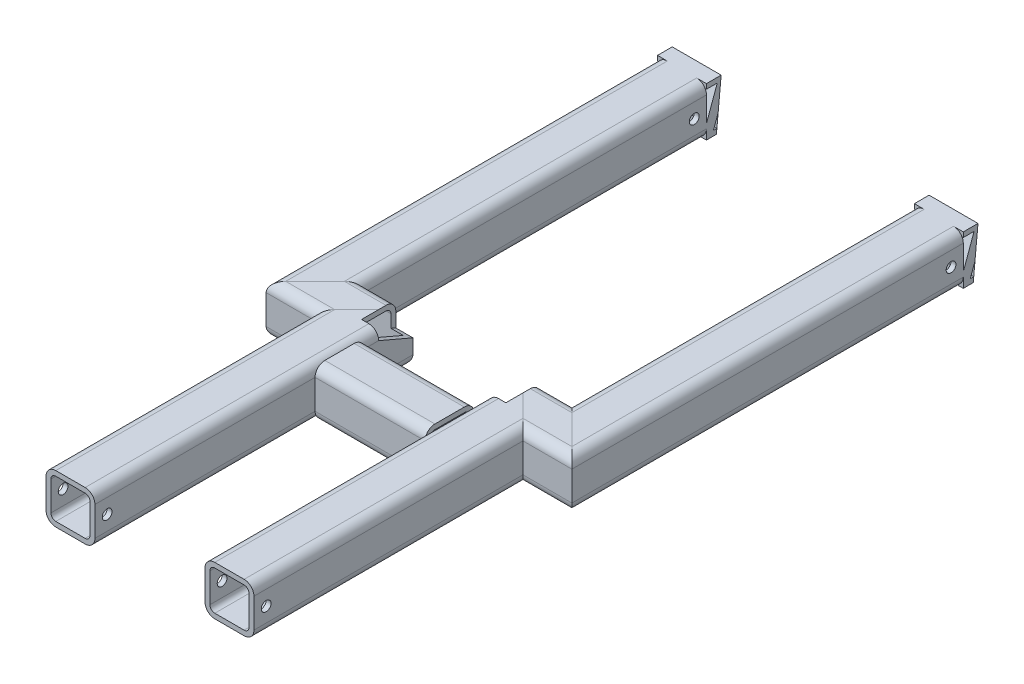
from build123d import *

# Parameters (mm, degrees)
SQUARE_TUBE_20_X_20_X_2_3_DEPTH        = 135.142135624
SQUARE_TUBE_20_X_20_X_2_3_2_DEPTH      = 50.284271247
SQUARE_TUBE_20_X_20_X_2_3_3_DEPTH      = 150
SQUARE_TUBE_20_X_20_X_2_3_3_DEPTH_BACK = 15.142135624
SQUARE_TUBE_20_X_20_X_2_3_4_DEPTH      = 45
SQUARE_TUBE_20_X_20_X_2_3_5_DEPTH      = 135.142135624
SQUARE_TUBE_20_X_20_X_2_3_6_DEPTH      = 50.284271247
SQUARE_TUBE_20_X_20_X_2_3_7_DEPTH      = 165.142135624
SKETCH18_R                             = 2
CUT_EXTRUDE2_DEPTH                     = 130
BOSS_EXTRUDE1_DEPTH                    = 20
BOSS_EXTRUDE2_DEPTH                    = 20
BOSS_EXTRUDE3_DEPTH                    = 20
CUT_EXTRUDE5_DEPTH                     = 52
CUT_EXTRUDE5_DEPTH_BACK                = 7
BOSS_EXTRUDE4_DEPTH                    = 20
CUT_EXTRUDE4_DEPTH                     = 130


with BuildPart() as part:
    # Sketch16 on segment 1 (on carried to segment 1) → Square tube 20 X 20 X 2_3 (new body)
    with BuildSketch(Plane(origin=(-99.182795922, 0, 100), x_dir=(-1, 0, 0), z_dir=(0, 0, -1))):
        with BuildLine():
            Line((-6, -10), (6, -10))
            ThreePointArc((6, -10), (8.828427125, -8.828427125), (10, -6))
            Line((10, -6), (10, 6))
            ThreePointArc((10, 6), (8.828427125, 8.828427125), (6, 10))
            Line((6, 10), (-6, 10))
            ThreePointArc((-6, 10), (-8.828427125, 8.828427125), (-10, 6))
            Line((-10, 6), (-10, -6))
            ThreePointArc((-10, -6), (-8.828427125, -8.828427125), (-6, -10))
        make_face()
        with BuildLine():
            Line((-6, -8), (6, -8))
            ThreePointArc((6, -8), (7.414213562, -7.414213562), (8, -6))
            Line((8, -6), (8, 6))
            ThreePointArc((8, 6), (7.414213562, 7.414213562), (6, 8))
            Line((6, 8), (-6, 8))
            ThreePointArc((-6, 8), (-7.414213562, 7.414213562), (-8, 6))
            Line((-8, 6), (-8, -6))
            ThreePointArc((-8, -6), (-7.414213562, -7.414213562), (-6, -8))
        make_face(mode=Mode.SUBTRACT)
    extrude(amount=SQUARE_TUBE_20_X_20_X_2_3_DEPTH)

    # Square tube 20 X 20 X 2_3 mitre 1
    split(bisect_by=Plane(origin=(-99.182795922, 0, -20), x_dir=(0, 1, 0), z_dir=(0.707106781, 0, 0.707106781)), keep=Keep.TOP)


with BuildPart() as body_2:
    # Sketch16 on segment 2 (on carried to segment 2) → Square tube 20 X 20 X 2_3 2 (new body)
    with BuildSketch(Plane(origin=(-84.040660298, 0, -20), x_dir=(0, 0, 1), z_dir=(-1, 0, 0))):
        with BuildLine():
            Line((-6, -10), (6, -10))
            ThreePointArc((6, -10), (8.828427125, -8.828427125), (10, -6))
            Line((10, -6), (10, 6))
            ThreePointArc((10, 6), (8.828427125, 8.828427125), (6, 10))
            Line((6, 10), (-6, 10))
            ThreePointArc((-6, 10), (-8.828427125, 8.828427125), (-10, 6))
            Line((-10, 6), (-10, -6))
            ThreePointArc((-10, -6), (-8.828427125, -8.828427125), (-6, -10))
        make_face()
        with BuildLine():
            Line((-6, -8), (6, -8))
            ThreePointArc((6, -8), (7.414213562, -7.414213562), (8, -6))
            Line((8, -6), (8, 6))
            ThreePointArc((8, 6), (7.414213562, 7.414213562), (6, 8))
            Line((6, 8), (-6, 8))
            ThreePointArc((-6, 8), (-7.414213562, 7.414213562), (-8, 6))
            Line((-8, 6), (-8, -6))
            ThreePointArc((-8, -6), (-7.414213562, -7.414213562), (-6, -8))
        make_face(mode=Mode.SUBTRACT)
    extrude(amount=SQUARE_TUBE_20_X_20_X_2_3_2_DEPTH)

    # Square tube 20 X 20 X 2_3 2 mitre 1
    split(bisect_by=Plane(origin=(-99.182795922, 0, -20), x_dir=(0, -1, 0), z_dir=(-0.707106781, 0, -0.707106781)), keep=Keep.TOP)

    # Square tube 20 X 20 X 2_3 2 mitre 2
    split(bisect_by=Plane(origin=(-119.182795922, 0, -20), x_dir=(0, 1, 0), z_dir=(0.707106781, 0, 0.707106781)), keep=Keep.TOP)


with BuildPart() as body_3:
    # Sketch16 → Square tube 20 X 20 X 2_3 3 (new, two sides: drawn at the far end of the back side and taken through both)
    with BuildSketch(Plane(origin=(-119.182795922, 0, -20), x_dir=(-1, 0, 0), z_dir=(0, 0, -1)).offset(-SQUARE_TUBE_20_X_20_X_2_3_3_DEPTH_BACK)):
        with BuildLine():
            Line((-6, -10), (6, -10))
            ThreePointArc((6, -10), (8.828427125, -8.828427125), (10, -6))
            Line((10, -6), (10, 6))
            ThreePointArc((10, 6), (8.828427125, 8.828427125), (6, 10))
            Line((6, 10), (-6, 10))
            ThreePointArc((-6, 10), (-8.828427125, 8.828427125), (-10, 6))
            Line((-10, 6), (-10, -6))
            ThreePointArc((-10, -6), (-8.828427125, -8.828427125), (-6, -10))
        make_face()
        with BuildLine():
            Line((-6, -8), (6, -8))
            ThreePointArc((6, -8), (7.414213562, -7.414213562), (8, -6))
            Line((8, -6), (8, 6))
            ThreePointArc((8, 6), (7.414213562, 7.414213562), (6, 8))
            Line((6, 8), (-6, 8))
            ThreePointArc((-6, 8), (-7.414213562, 7.414213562), (-8, 6))
            Line((-8, 6), (-8, -6))
            ThreePointArc((-8, -6), (-7.414213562, -7.414213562), (-6, -8))
        make_face(mode=Mode.SUBTRACT)
    extrude(amount=SQUARE_TUBE_20_X_20_X_2_3_3_DEPTH + SQUARE_TUBE_20_X_20_X_2_3_3_DEPTH_BACK)

    # Square tube 20 X 20 X 2_3 3 mitre 1
    split(bisect_by=Plane(origin=(-119.182795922, 0, -20), x_dir=(0, -1, 0), z_dir=(-0.707106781, 0, -0.707106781)), keep=Keep.TOP)


with BuildPart() as body_4:
    # Sketch16 on segment 4 (on carried to segment 4) → Square tube 20 X 20 X 2_3 4 (new body)
    with BuildSketch(Plane(origin=(-89.182795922, 0, 0), x_dir=(0, 0, -1), z_dir=(1, 0, 0))):
        with BuildLine():
            Line((-6, -10), (6, -10))
            ThreePointArc((6, -10), (8.828427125, -8.828427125), (10, -6))
            Line((10, -6), (10, 6))
            ThreePointArc((10, 6), (8.828427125, 8.828427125), (6, 10))
            Line((6, 10), (-6, 10))
            ThreePointArc((-6, 10), (-8.828427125, 8.828427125), (-10, 6))
            Line((-10, 6), (-10, -6))
            ThreePointArc((-10, -6), (-8.828427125, -8.828427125), (-6, -10))
        make_face()
        with BuildLine():
            Line((-6, -8), (6, -8))
            ThreePointArc((6, -8), (7.414213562, -7.414213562), (8, -6))
            Line((8, -6), (8, 6))
            ThreePointArc((8, 6), (7.414213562, 7.414213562), (6, 8))
            Line((6, 8), (-6, 8))
            ThreePointArc((-6, 8), (-7.414213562, 7.414213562), (-8, 6))
            Line((-8, 6), (-8, -6))
            ThreePointArc((-8, -6), (-7.414213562, -7.414213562), (-6, -8))
        make_face(mode=Mode.SUBTRACT)
    extrude(amount=SQUARE_TUBE_20_X_20_X_2_3_4_DEPTH)


with BuildPart() as body_5:
    # Sketch16 on segment 5 (on carried to segment 5) → Square tube 20 X 20 X 2_3 5 (new body)
    with BuildSketch(Plane(origin=(-34.182795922, 0, 100), x_dir=(-1, 0, 0), z_dir=(0, 0, -1))):
        with BuildLine():
            Line((-6, -10), (6, -10))
            ThreePointArc((6, -10), (8.828427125, -8.828427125), (10, -6))
            Line((10, -6), (10, 6))
            ThreePointArc((10, 6), (8.828427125, 8.828427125), (6, 10))
            Line((6, 10), (-6, 10))
            ThreePointArc((-6, 10), (-8.828427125, 8.828427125), (-10, 6))
            Line((-10, 6), (-10, -6))
            ThreePointArc((-10, -6), (-8.828427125, -8.828427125), (-6, -10))
        make_face()
        with BuildLine():
            Line((-6, -8), (6, -8))
            ThreePointArc((6, -8), (7.414213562, -7.414213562), (8, -6))
            Line((8, -6), (8, 6))
            ThreePointArc((8, 6), (7.414213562, 7.414213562), (6, 8))
            Line((6, 8), (-6, 8))
            ThreePointArc((-6, 8), (-7.414213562, 7.414213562), (-8, 6))
            Line((-8, 6), (-8, -6))
            ThreePointArc((-8, -6), (-7.414213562, -7.414213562), (-6, -8))
        make_face(mode=Mode.SUBTRACT)
    extrude(amount=SQUARE_TUBE_20_X_20_X_2_3_5_DEPTH)

    # Square tube 20 X 20 X 2_3 5 mitre 1
    split(bisect_by=Plane(origin=(-34.182795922, 0, -20), x_dir=(0, -1, 0), z_dir=(-0.707106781, 0, 0.707106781)), keep=Keep.TOP)


with BuildPart() as body_6:
    # Sketch16 on segment 6 (on carried to segment 6) → Square tube 20 X 20 X 2_3 6 (new body)
    with BuildSketch(Plane(origin=(-49.324931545, 0, -20), x_dir=(0, 0, -1), z_dir=(1, 0, 0))):
        with BuildLine():
            Line((-6, -10), (6, -10))
            ThreePointArc((6, -10), (8.828427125, -8.828427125), (10, -6))
            Line((10, -6), (10, 6))
            ThreePointArc((10, 6), (8.828427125, 8.828427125), (6, 10))
            Line((6, 10), (-6, 10))
            ThreePointArc((-6, 10), (-8.828427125, 8.828427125), (-10, 6))
            Line((-10, 6), (-10, -6))
            ThreePointArc((-10, -6), (-8.828427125, -8.828427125), (-6, -10))
        make_face()
        with BuildLine():
            Line((-6, -8), (6, -8))
            ThreePointArc((6, -8), (7.414213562, -7.414213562), (8, -6))
            Line((8, -6), (8, 6))
            ThreePointArc((8, 6), (7.414213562, 7.414213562), (6, 8))
            Line((6, 8), (-6, 8))
            ThreePointArc((-6, 8), (-7.414213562, 7.414213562), (-8, 6))
            Line((-8, 6), (-8, -6))
            ThreePointArc((-8, -6), (-7.414213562, -7.414213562), (-6, -8))
        make_face(mode=Mode.SUBTRACT)
    extrude(amount=SQUARE_TUBE_20_X_20_X_2_3_6_DEPTH)

    # Square tube 20 X 20 X 2_3 6 mitre 1
    split(bisect_by=Plane(origin=(-34.182795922, 0, -20), x_dir=(0, 1, 0), z_dir=(0.707106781, 0, -0.707106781)), keep=Keep.TOP)

    # Square tube 20 X 20 X 2_3 6 mitre 2
    split(bisect_by=Plane(origin=(-14.182795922, 0, -20), x_dir=(0, -1, 0), z_dir=(-0.707106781, 0, 0.707106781)), keep=Keep.TOP)


with BuildPart() as body_7:
    # Sketch16 on segment 7 (on carried to segment 7) → Square tube 20 X 20 X 2_3 7 (new body)
    with BuildSketch(Plane(origin=(-14.182795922, 0, -4.857864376), x_dir=(-1, 0, 0), z_dir=(0, 0, -1))):
        with BuildLine():
            Line((-6, -10), (6, -10))
            ThreePointArc((6, -10), (8.828427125, -8.828427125), (10, -6))
            Line((10, -6), (10, 6))
            ThreePointArc((10, 6), (8.828427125, 8.828427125), (6, 10))
            Line((6, 10), (-6, 10))
            ThreePointArc((-6, 10), (-8.828427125, 8.828427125), (-10, 6))
            Line((-10, 6), (-10, -6))
            ThreePointArc((-10, -6), (-8.828427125, -8.828427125), (-6, -10))
        make_face()
        with BuildLine():
            Line((-6, -8), (6, -8))
            ThreePointArc((6, -8), (7.414213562, -7.414213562), (8, -6))
            Line((8, -6), (8, 6))
            ThreePointArc((8, 6), (7.414213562, 7.414213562), (6, 8))
            Line((6, 8), (-6, 8))
            ThreePointArc((-6, 8), (-7.414213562, 7.414213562), (-8, 6))
            Line((-8, 6), (-8, -6))
            ThreePointArc((-8, -6), (-7.414213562, -7.414213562), (-6, -8))
        make_face(mode=Mode.SUBTRACT)
    extrude(amount=SQUARE_TUBE_20_X_20_X_2_3_7_DEPTH)

    # Square tube 20 X 20 X 2_3 7 mitre 1
    split(bisect_by=Plane(origin=(-14.182795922, 0, -20), x_dir=(0, 1, 0), z_dir=(0.707106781, 0, -0.707106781)), keep=Keep.TOP)


with BuildPart() as part_1:
    add(part.part)

    # Square tube 20 X 20 X 2_3 as one body: union body 2, body 3
    add(body_2.part)
    add(body_3.part)


with BuildPart() as body_5_1:
    add(body_5.part)

    # Square tube 20 X 20 X 2_3 as one body 2: union body 6, body 7
    add(body_6.part)
    add(body_7.part)


with BuildPart() as cut_extrude2_tool:
    # Sketch18 → Cut-Extrude2 (new body)
    with BuildSketch(Plane(origin=(-4.182795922, 0, 0), x_dir=(0, 0, -1), z_dir=(1, 0, 0))):
        with Locations((165, 0)):
            Circle(SKETCH18_R)
        with Locations((-95, 0)):
            Circle(SKETCH18_R)
    extrude(amount=-CUT_EXTRUDE2_DEPTH)


with BuildPart() as part_2:
    add(part_1.part)

    # Cut-Extrude2: cut by cut_extrude2_tool
    add(cut_extrude2_tool.part, mode=Mode.SUBTRACT)

    # Sketch19 → Boss-Extrude1 (add)
    with BuildSketch(Plane.ZY.offset(129.182795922)):
        Polygon((-177.279404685, 10), (-176.551464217, 8), (-174.423108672, 8), (-175.15104914, 10), align=None)
        Polygon((-175.15104914, 10), (-174.423108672, 8), (-170, 8), (-170, 10), align=None)
        Polygon((-176.551464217, 8), (-170, -10), (-170, -6), (-170, -4.1523912), (-174.423108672, 8), align=None)
    extrude(amount=-BOSS_EXTRUDE1_DEPTH)

    # Sketch21 → Boss-Extrude3 (add)
    with BuildSketch(Plane.ZY.offset(129.182795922)):
        Polygon((-177.279404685, 10), (-178.019404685, 10), (-176.08, -10), (-170, -10), (-170.355443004, -6.334514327), (-176.300720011, 10), align=None)
        Polygon((-174.264559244, -8), (-172.856296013, -8), (-174.776018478, -2.725605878), align=None, mode=Mode.SUBTRACT)
    extrude(amount=-BOSS_EXTRUDE3_DEPTH)


with BuildPart() as body_5_2:
    add(body_5_1.part)

    # Cut-Extrude2: cut by cut_extrude2_tool
    add(cut_extrude2_tool.part, mode=Mode.SUBTRACT)

    # Sketch20 → Boss-Extrude2 (add)
    with BuildSketch(Plane.ZY.offset(24.182795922)):
        Polygon((-174.423108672, 8), (-176.551464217, 8), (-170, -10), (-170, -6), (-170, -4.1523912), align=None)
        Polygon((-177.279404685, 10), (-176.551464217, 8), (-174.423108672, 8), (-175.15104914, 10), align=None)
        Polygon((-175.15104914, 10), (-174.423108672, 8), (-170, 8), (-170, 10), align=None)
    extrude(amount=-BOSS_EXTRUDE2_DEPTH)


with BuildPart() as cut_extrude5_tool:
    # Sketch26 → Cut-Extrude5 (new, two sides: drawn at the far end of the back side and taken through both)
    with BuildSketch(Plane(origin=(-89.182795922, 0, 0), x_dir=(0, 0, -1), z_dir=(1, 0, 0)).offset(-CUT_EXTRUDE5_DEPTH_BACK)):
        Polygon((16, 6), (30, 0), (30, 12.406982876), (16, 12.406982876), align=None)
    extrude(amount=CUT_EXTRUDE5_DEPTH + CUT_EXTRUDE5_DEPTH_BACK)


with BuildPart() as part_3:
    add(part_2.part)

    # Cut-Extrude5: cut by cut_extrude5_tool
    add(cut_extrude5_tool.part, mode=Mode.SUBTRACT)


with BuildPart() as body_5_3:
    add(body_5_2.part)

    # Cut-Extrude5: cut by cut_extrude5_tool
    add(cut_extrude5_tool.part, mode=Mode.SUBTRACT)

    # Sketch22 → Boss-Extrude4 (add)
    with BuildSketch(Plane.ZY.offset(24.182795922)):
        Polygon((-177.279404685, 10), (-178.019404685, 10), (-176.08, -10), (-170, -10), (-170.355443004, -6.334514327), (-176.300720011, 10), align=None)
        Polygon((-174.264559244, -8), (-172.856296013, -8), (-174.776018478, -2.725605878), align=None, mode=Mode.SUBTRACT)
    extrude(amount=-BOSS_EXTRUDE4_DEPTH)


with BuildPart() as cut_extrude4_tool:
    # Sketch23 → Cut-Extrude4 (new body)
    with BuildSketch(Plane.ZY.offset(129.182795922)):
        Polygon((-176.363006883, 13.572213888), (-173.608413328, -14.834374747), (-181.558679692, -15.464077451), (-184.374335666, 13.572213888), align=None)
    extrude(amount=-CUT_EXTRUDE4_DEPTH)


with BuildPart() as part_4:
    add(part_3.part)

    # Cut-Extrude4: cut by cut_extrude4_tool
    add(cut_extrude4_tool.part, mode=Mode.SUBTRACT)


with BuildPart() as body_5_4:
    add(body_5_3.part)

    # Cut-Extrude4: cut by cut_extrude4_tool
    add(cut_extrude4_tool.part, mode=Mode.SUBTRACT)


solid = Compound([body_4.part, part_4.part, body_5_4.part])
